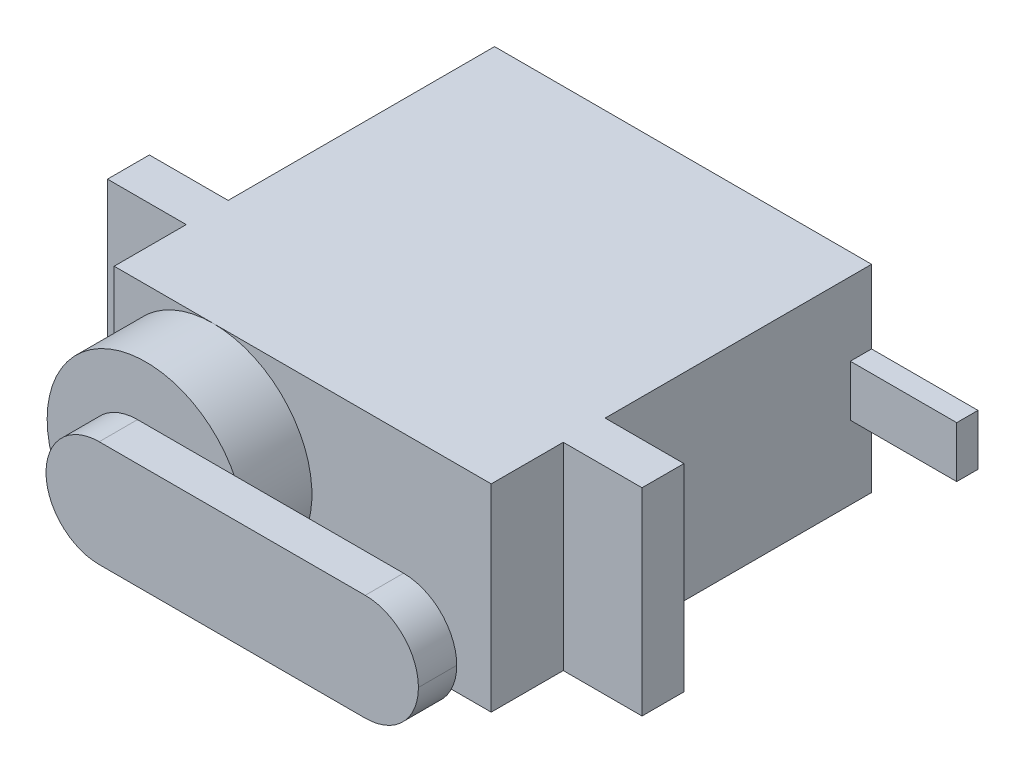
ISO-10303-21;
HEADER;
FILE_DESCRIPTION(('STEP AP214'),'2;1');
FILE_NAME('part.step','',(''),(''),'','','');
FILE_SCHEMA(('AUTOMOTIVE_DESIGN { 1 0 10303 214 1 1 1 1 }'));
ENDSEC;
DATA;
#1=APPLICATION_CONTEXT('core data for automotive mechanical design processes');
#2=APPLICATION_PROTOCOL_DEFINITION('international standard','automotive_design',2000,#1);
#3=PRODUCT_CONTEXT('',#1,'mechanical');
#4=PRODUCT('Part','Part','',(#3));
#5=PRODUCT_RELATED_PRODUCT_CATEGORY('part','',(#4));
#6=PRODUCT_DEFINITION_FORMATION('','',#4);
#7=PRODUCT_DEFINITION_CONTEXT('part definition',#1,'design');
#8=PRODUCT_DEFINITION('design','',#6,#7);
#9=PRODUCT_DEFINITION_SHAPE('','',#8);
#10=(LENGTH_UNIT() NAMED_UNIT(*) SI_UNIT(.MILLI.,.METRE.));
#11=(NAMED_UNIT(*) PLANE_ANGLE_UNIT() SI_UNIT($,.RADIAN.));
#12=(NAMED_UNIT(*) SI_UNIT($,.STERADIAN.) SOLID_ANGLE_UNIT());
#13=UNCERTAINTY_MEASURE_WITH_UNIT(LENGTH_MEASURE(1.E-05),#10,'distance_accuracy_value','');
#14=(GEOMETRIC_REPRESENTATION_CONTEXT(3) GLOBAL_UNCERTAINTY_ASSIGNED_CONTEXT((#13)) GLOBAL_UNIT_ASSIGNED_CONTEXT((#10,
#11,#12)) REPRESENTATION_CONTEXT('',''));
#15=CARTESIAN_POINT('',(0.,0.,0.));
#16=DIRECTION('',(0.,0.,1.));
#17=DIRECTION('',(1.,0.,0.));
#18=AXIS2_PLACEMENT_3D('',#15,#16,#17);
#19=CARTESIAN_POINT('',(11.25,5.9,15.9));
#20=DIRECTION('',(-1.,0.,0.));
#21=DIRECTION('',(0.,0.,1.));
#22=AXIS2_PLACEMENT_3D('',#19,#20,#21);
#23=PLANE('',#22);
#24=DIRECTION('',(0.,0.,-1.));
#25=VECTOR('',#24,1.);
#26=CARTESIAN_POINT('',(11.25,-1.524,1.27));
#27=LINE('',#26,#25);
#28=CARTESIAN_POINT('',(11.25,-1.524,1.27));
#29=VERTEX_POINT('',#28);
#30=CARTESIAN_POINT('',(11.25,-1.524,0.));
#31=VERTEX_POINT('',#30);
#32=EDGE_CURVE('E62',#29,#31,#27,.T.);
#33=ORIENTED_EDGE('',*,*,#32,.F.);
#34=DIRECTION('',(0.,-1.,0.));
#35=VECTOR('',#34,1.);
#36=CARTESIAN_POINT('',(11.25,1.524,1.27));
#37=LINE('',#36,#35);
#38=CARTESIAN_POINT('',(11.25,1.524,1.27));
#39=VERTEX_POINT('',#38);
#40=EDGE_CURVE('E67',#39,#29,#37,.T.);
#41=ORIENTED_EDGE('',*,*,#40,.F.);
#42=DIRECTION('',(0.,0.,1.));
#43=VECTOR('',#42,1.);
#44=CARTESIAN_POINT('',(11.25,1.524,1.27));
#45=LINE('',#44,#43);
#46=CARTESIAN_POINT('',(11.25,1.524,0.));
#47=VERTEX_POINT('',#46);
#48=EDGE_CURVE('E218',#47,#39,#45,.T.);
#49=ORIENTED_EDGE('',*,*,#48,.F.);
#50=DIRECTION('',(0.,1.,0.));
#51=VECTOR('',#50,1.);
#52=CARTESIAN_POINT('',(11.25,5.9,0.));
#53=LINE('',#52,#51);
#54=CARTESIAN_POINT('',(11.25,5.9,0.));
#55=VERTEX_POINT('',#54);
#56=EDGE_CURVE('E366',#47,#55,#53,.T.);
#57=ORIENTED_EDGE('',*,*,#56,.T.);
#58=DIRECTION('',(0.,0.,-1.));
#59=VECTOR('',#58,1.);
#60=CARTESIAN_POINT('',(11.25,5.9,15.9));
#61=LINE('',#60,#59);
#62=CARTESIAN_POINT('',(11.25,5.9,15.9));
#63=VERTEX_POINT('',#62);
#64=EDGE_CURVE('E399',#63,#55,#61,.T.);
#65=ORIENTED_EDGE('',*,*,#64,.F.);
#66=DIRECTION('',(0.,1.,0.));
#67=VECTOR('',#66,1.);
#68=CARTESIAN_POINT('',(11.25,5.9,15.9));
#69=LINE('',#68,#67);
#70=CARTESIAN_POINT('',(11.25,-5.9,15.9));
#71=VERTEX_POINT('',#70);
#72=EDGE_CURVE('E367',#71,#63,#69,.T.);
#73=ORIENTED_EDGE('',*,*,#72,.F.);
#74=DIRECTION('',(0.,0.,-1.));
#75=VECTOR('',#74,1.);
#76=CARTESIAN_POINT('',(11.25,-5.9,15.9));
#77=LINE('',#76,#75);
#78=CARTESIAN_POINT('',(11.25,-5.9,0.));
#79=VERTEX_POINT('',#78);
#80=EDGE_CURVE('E376',#71,#79,#77,.T.);
#81=ORIENTED_EDGE('',*,*,#80,.T.);
#82=EDGE_CURVE('E377',#79,#31,#53,.T.);
#83=ORIENTED_EDGE('',*,*,#82,.T.);
#84=EDGE_LOOP('',(#33,#41,#49,#57,#65,#73,#81,#83));
#85=FACE_BOUND('',#84,.T.);
#86=ADVANCED_FACE('F45',(#85),#23,.F.);
#87=CARTESIAN_POINT('',(0.,0.,22.7));
#88=DIRECTION('',(0.,0.,-1.));
#89=DIRECTION('',(-1.,0.,0.));
#90=AXIS2_PLACEMENT_3D('',#87,#88,#89);
#91=PLANE('',#90);
#92=CARTESIAN_POINT('',(-5.35000000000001,0.,22.7));
#93=DIRECTION('',(0.,0.,1.));
#94=DIRECTION('',(1.,0.,0.));
#95=AXIS2_PLACEMENT_3D('',#92,#93,#94);
#96=CIRCLE('',#95,5.9);
#97=CARTESIAN_POINT('',(-5.35000000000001,5.9,22.7));
#98=VERTEX_POINT('',#97);
#99=CARTESIAN_POINT('',(-11.25,0.,22.7));
#100=VERTEX_POINT('',#99);
#101=EDGE_CURVE('E262',#98,#100,#96,.T.);
#102=ORIENTED_EDGE('',*,*,#101,.F.);
#103=DIRECTION('',(-1.,0.,0.));
#104=VECTOR('',#103,1.);
#105=CARTESIAN_POINT('',(-11.25,5.9,22.7));
#106=LINE('',#105,#104);
#107=CARTESIAN_POINT('',(-11.25,5.9,22.7));
#108=VERTEX_POINT('',#107);
#109=EDGE_CURVE('E291',#98,#108,#106,.T.);
#110=ORIENTED_EDGE('',*,*,#109,.T.);
#111=DIRECTION('',(0.,-1.,0.));
#112=VECTOR('',#111,1.);
#113=CARTESIAN_POINT('',(-11.25,-5.9,22.7));
#114=LINE('',#113,#112);
#115=EDGE_CURVE('E278',#108,#100,#114,.T.);
#116=ORIENTED_EDGE('',*,*,#115,.T.);
#117=EDGE_LOOP('',(#102,#110,#116));
#118=FACE_BOUND('',#117,.T.);
#119=ADVANCED_FACE('F454',(#118),#91,.F.);
#120=CARTESIAN_POINT('',(-5.35,-5.9,22.7));
#121=VERTEX_POINT('',#120);
#122=EDGE_CURVE('E268',#100,#121,#96,.T.);
#123=ORIENTED_EDGE('',*,*,#122,.F.);
#124=CARTESIAN_POINT('',(-11.25,-5.9,22.7));
#125=VERTEX_POINT('',#124);
#126=EDGE_CURVE('E283',#100,#125,#114,.T.);
#127=ORIENTED_EDGE('',*,*,#126,.T.);
#128=DIRECTION('',(1.,0.,0.));
#129=VECTOR('',#128,1.);
#130=CARTESIAN_POINT('',(-11.25,-5.9,22.7));
#131=LINE('',#130,#129);
#132=EDGE_CURVE('E284',#125,#121,#131,.T.);
#133=ORIENTED_EDGE('',*,*,#132,.T.);
#134=EDGE_LOOP('',(#123,#127,#133));
#135=FACE_BOUND('',#134,.T.);
#136=ADVANCED_FACE('F461',(#135),#91,.F.);
#137=CARTESIAN_POINT('',(0.,0.,18.4));
#138=DIRECTION('',(0.,0.,-1.));
#139=DIRECTION('',(-1.,0.,0.));
#140=AXIS2_PLACEMENT_3D('',#137,#138,#139);
#141=PLANE('',#140);
#142=DIRECTION('',(0.,-1.,0.));
#143=VECTOR('',#142,1.);
#144=CARTESIAN_POINT('',(-11.25,-5.9,18.4));
#145=LINE('',#144,#143);
#146=CARTESIAN_POINT('',(-11.25,5.9,18.4));
#147=VERTEX_POINT('',#146);
#148=CARTESIAN_POINT('',(-11.25,-5.9,18.4));
#149=VERTEX_POINT('',#148);
#150=EDGE_CURVE('E273',#147,#149,#145,.T.);
#151=ORIENTED_EDGE('',*,*,#150,.F.);
#152=DIRECTION('',(-1.,0.,0.));
#153=VECTOR('',#152,1.);
#154=CARTESIAN_POINT('',(-15.95,5.9,18.4));
#155=LINE('',#154,#153);
#156=CARTESIAN_POINT('',(-15.95,5.9,18.4));
#157=VERTEX_POINT('',#156);
#158=EDGE_CURVE('E331',#147,#157,#155,.T.);
#159=ORIENTED_EDGE('',*,*,#158,.T.);
#160=DIRECTION('',(0.,-1.,0.));
#161=VECTOR('',#160,1.);
#162=CARTESIAN_POINT('',(-15.95,-5.9,18.4));
#163=LINE('',#162,#161);
#164=CARTESIAN_POINT('',(-15.95,-5.9,18.4));
#165=VERTEX_POINT('',#164);
#166=EDGE_CURVE('E319',#157,#165,#163,.T.);
#167=ORIENTED_EDGE('',*,*,#166,.T.);
#168=DIRECTION('',(1.,0.,0.));
#169=VECTOR('',#168,1.);
#170=CARTESIAN_POINT('',(-15.95,-5.9,18.4));
#171=LINE('',#170,#169);
#172=EDGE_CURVE('E325',#165,#149,#171,.T.);
#173=ORIENTED_EDGE('',*,*,#172,.T.);
#174=EDGE_LOOP('',(#151,#159,#167,#173));
#175=FACE_BOUND('',#174,.T.);
#176=ADVANCED_FACE('F605',(#175),#141,.F.);
#177=DIRECTION('',(0.,1.,0.));
#178=VECTOR('',#177,1.);
#179=CARTESIAN_POINT('',(11.25,-5.89999999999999,18.4));
#180=LINE('',#179,#178);
#181=CARTESIAN_POINT('',(11.25,-5.9,18.4));
#182=VERTEX_POINT('',#181);
#183=CARTESIAN_POINT('',(11.25,5.9,18.4));
#184=VERTEX_POINT('',#183);
#185=EDGE_CURVE('E299',#182,#184,#180,.T.);
#186=ORIENTED_EDGE('',*,*,#185,.F.);
#187=CARTESIAN_POINT('',(15.95,-5.9,18.4));
#188=VERTEX_POINT('',#187);
#189=EDGE_CURVE('E323',#182,#188,#171,.T.);
#190=ORIENTED_EDGE('',*,*,#189,.T.);
#191=DIRECTION('',(0.,1.,0.));
#192=VECTOR('',#191,1.);
#193=CARTESIAN_POINT('',(15.95,-5.9,18.4));
#194=LINE('',#193,#192);
#195=CARTESIAN_POINT('',(15.95,5.9,18.4));
#196=VERTEX_POINT('',#195);
#197=EDGE_CURVE('E328',#188,#196,#194,.T.);
#198=ORIENTED_EDGE('',*,*,#197,.T.);
#199=EDGE_CURVE('E332',#196,#184,#155,.T.);
#200=ORIENTED_EDGE('',*,*,#199,.T.);
#201=EDGE_LOOP('',(#186,#190,#198,#200));
#202=FACE_BOUND('',#201,.T.);
#203=ADVANCED_FACE('F653',(#202),#141,.F.);
#204=CARTESIAN_POINT('',(-11.25,5.9,15.9));
#205=DIRECTION('',(0.,-1.,0.));
#206=DIRECTION('',(0.,0.,-1.));
#207=AXIS2_PLACEMENT_3D('',#204,#205,#206);
#208=PLANE('',#207);
#209=DIRECTION('',(-1.,0.,0.));
#210=VECTOR('',#209,1.);
#211=CARTESIAN_POINT('',(-11.25,5.9,0.));
#212=LINE('',#211,#210);
#213=CARTESIAN_POINT('',(-11.25,5.9,0.));
#214=VERTEX_POINT('',#213);
#215=EDGE_CURVE('E380',#55,#214,#212,.T.);
#216=ORIENTED_EDGE('',*,*,#215,.T.);
#217=DIRECTION('',(0.,0.,-1.));
#218=VECTOR('',#217,1.);
#219=CARTESIAN_POINT('',(-11.25,5.9,15.9));
#220=LINE('',#219,#218);
#221=CARTESIAN_POINT('',(-11.25,5.9,15.9));
#222=VERTEX_POINT('',#221);
#223=EDGE_CURVE('E395',#222,#214,#220,.T.);
#224=ORIENTED_EDGE('',*,*,#223,.F.);
#225=DIRECTION('',(-1.,0.,0.));
#226=VECTOR('',#225,1.);
#227=CARTESIAN_POINT('',(-15.95,5.9,15.9));
#228=LINE('',#227,#226);
#229=CARTESIAN_POINT('',(-15.95,5.9,15.9));
#230=VERTEX_POINT('',#229);
#231=EDGE_CURVE('E347',#222,#230,#228,.T.);
#232=ORIENTED_EDGE('',*,*,#231,.T.);
#233=DIRECTION('',(0.,0.,-1.));
#234=VECTOR('',#233,1.);
#235=CARTESIAN_POINT('',(-15.95,5.9,18.4));
#236=LINE('',#235,#234);
#237=EDGE_CURVE('E335',#157,#230,#236,.T.);
#238=ORIENTED_EDGE('',*,*,#237,.F.);
#239=ORIENTED_EDGE('',*,*,#158,.F.);
#240=DIRECTION('',(0.,0.,-1.));
#241=VECTOR('',#240,1.);
#242=CARTESIAN_POINT('',(-11.25,5.9,22.7));
#243=LINE('',#242,#241);
#244=EDGE_CURVE('E295',#108,#147,#243,.T.);
#245=ORIENTED_EDGE('',*,*,#244,.F.);
#246=ORIENTED_EDGE('',*,*,#109,.F.);
#247=CARTESIAN_POINT('',(11.25,5.9,22.7));
#248=VERTEX_POINT('',#247);
#249=EDGE_CURVE('E292',#248,#98,#106,.T.);
#250=ORIENTED_EDGE('',*,*,#249,.F.);
#251=DIRECTION('',(0.,0.,-1.));
#252=VECTOR('',#251,1.);
#253=CARTESIAN_POINT('',(11.25,5.9,22.7));
#254=LINE('',#253,#252);
#255=EDGE_CURVE('E306',#248,#184,#254,.T.);
#256=ORIENTED_EDGE('',*,*,#255,.T.);
#257=ORIENTED_EDGE('',*,*,#199,.F.);
#258=DIRECTION('',(0.,0.,-1.));
#259=VECTOR('',#258,1.);
#260=CARTESIAN_POINT('',(15.95,5.9,18.4));
#261=LINE('',#260,#259);
#262=CARTESIAN_POINT('',(15.95,5.9,15.9));
#263=VERTEX_POINT('',#262);
#264=EDGE_CURVE('E354',#196,#263,#261,.T.);
#265=ORIENTED_EDGE('',*,*,#264,.T.);
#266=EDGE_CURVE('E324',#263,#63,#228,.T.);
#267=ORIENTED_EDGE('',*,*,#266,.T.);
#268=ORIENTED_EDGE('',*,*,#64,.T.);
#269=EDGE_LOOP('',(#216,#224,#232,#238,#239,#245,#246,#250,#256,#257,#265,#267,#268));
#270=FACE_BOUND('',#269,.T.);
#271=ADVANCED_FACE('F466',(#270),#208,.F.);
#272=CARTESIAN_POINT('',(-11.25,5.9,15.9));
#273=DIRECTION('',(1.,0.,0.));
#274=DIRECTION('',(0.,0.,-1.));
#275=AXIS2_PLACEMENT_3D('',#272,#273,#274);
#276=PLANE('',#275);
#277=DIRECTION('',(0.,-1.,0.));
#278=VECTOR('',#277,1.);
#279=CARTESIAN_POINT('',(-11.25,5.9,0.));
#280=LINE('',#279,#278);
#281=CARTESIAN_POINT('',(-11.25,-5.9,0.));
#282=VERTEX_POINT('',#281);
#283=EDGE_CURVE('E383',#214,#282,#280,.T.);
#284=ORIENTED_EDGE('',*,*,#283,.T.);
#285=DIRECTION('',(0.,0.,-1.));
#286=VECTOR('',#285,1.);
#287=CARTESIAN_POINT('',(-11.25,-5.9,15.9));
#288=LINE('',#287,#286);
#289=CARTESIAN_POINT('',(-11.25,-5.9,15.9));
#290=VERTEX_POINT('',#289);
#291=EDGE_CURVE('E391',#290,#282,#288,.T.);
#292=ORIENTED_EDGE('',*,*,#291,.F.);
#293=DIRECTION('',(0.,-1.,0.));
#294=VECTOR('',#293,1.);
#295=CARTESIAN_POINT('',(-11.25,5.9,15.9));
#296=LINE('',#295,#294);
#297=EDGE_CURVE('E371',#222,#290,#296,.T.);
#298=ORIENTED_EDGE('',*,*,#297,.F.);
#299=ORIENTED_EDGE('',*,*,#223,.T.);
#300=EDGE_LOOP('',(#284,#292,#298,#299));
#301=FACE_BOUND('',#300,.T.);
#302=ADVANCED_FACE('F642',(#301),#276,.F.);
#303=CARTESIAN_POINT('',(-11.25,-5.9,15.9));
#304=DIRECTION('',(0.,1.,0.));
#305=DIRECTION('',(0.,0.,1.));
#306=AXIS2_PLACEMENT_3D('',#303,#304,#305);
#307=PLANE('',#306);
#308=DIRECTION('',(1.,0.,0.));
#309=VECTOR('',#308,1.);
#310=CARTESIAN_POINT('',(-11.25,-5.9,0.));
#311=LINE('',#310,#309);
#312=EDGE_CURVE('E372',#282,#79,#311,.T.);
#313=ORIENTED_EDGE('',*,*,#312,.T.);
#314=ORIENTED_EDGE('',*,*,#80,.F.);
#315=DIRECTION('',(1.,0.,0.));
#316=VECTOR('',#315,1.);
#317=CARTESIAN_POINT('',(-15.95,-5.9,15.9));
#318=LINE('',#317,#316);
#319=CARTESIAN_POINT('',(15.95,-5.9,15.9));
#320=VERTEX_POINT('',#319);
#321=EDGE_CURVE('E339',#71,#320,#318,.T.);
#322=ORIENTED_EDGE('',*,*,#321,.T.);
#323=DIRECTION('',(0.,0.,-1.));
#324=VECTOR('',#323,1.);
#325=CARTESIAN_POINT('',(15.95,-5.9,18.4));
#326=LINE('',#325,#324);
#327=EDGE_CURVE('E358',#188,#320,#326,.T.);
#328=ORIENTED_EDGE('',*,*,#327,.F.);
#329=ORIENTED_EDGE('',*,*,#189,.F.);
#330=DIRECTION('',(0.,0.,-1.));
#331=VECTOR('',#330,1.);
#332=CARTESIAN_POINT('',(11.25,-5.89999999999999,22.7));
#333=LINE('',#332,#331);
#334=CARTESIAN_POINT('',(11.25,-5.89999999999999,22.7));
#335=VERTEX_POINT('',#334);
#336=EDGE_CURVE('E310',#335,#182,#333,.T.);
#337=ORIENTED_EDGE('',*,*,#336,.F.);
#338=EDGE_CURVE('E282',#121,#335,#131,.T.);
#339=ORIENTED_EDGE('',*,*,#338,.F.);
#340=ORIENTED_EDGE('',*,*,#132,.F.);
#341=DIRECTION('',(0.,0.,-1.));
#342=VECTOR('',#341,1.);
#343=CARTESIAN_POINT('',(-11.25,-5.9,22.7));
#344=LINE('',#343,#342);
#345=EDGE_CURVE('E314',#125,#149,#344,.T.);
#346=ORIENTED_EDGE('',*,*,#345,.T.);
#347=ORIENTED_EDGE('',*,*,#172,.F.);
#348=DIRECTION('',(0.,0.,-1.));
#349=VECTOR('',#348,1.);
#350=CARTESIAN_POINT('',(-15.95,-5.9,18.4));
#351=LINE('',#350,#349);
#352=CARTESIAN_POINT('',(-15.95,-5.9,15.9));
#353=VERTEX_POINT('',#352);
#354=EDGE_CURVE('E362',#165,#353,#351,.T.);
#355=ORIENTED_EDGE('',*,*,#354,.T.);
#356=EDGE_CURVE('E340',#353,#290,#318,.T.);
#357=ORIENTED_EDGE('',*,*,#356,.T.);
#358=ORIENTED_EDGE('',*,*,#291,.T.);
#359=EDGE_LOOP('',(#313,#314,#322,#328,#329,#337,#339,#340,#346,#347,#355,#357,#358));
#360=FACE_BOUND('',#359,.T.);
#361=ADVANCED_FACE('F514',(#360),#307,.F.);
#362=CARTESIAN_POINT('',(0.,0.,0.));
#363=DIRECTION('',(0.,0.,1.));
#364=DIRECTION('',(1.,0.,0.));
#365=AXIS2_PLACEMENT_3D('',#362,#363,#364);
#366=PLANE('',#365);
#367=ORIENTED_EDGE('',*,*,#82,.F.);
#368=ORIENTED_EDGE('',*,*,#312,.F.);
#369=ORIENTED_EDGE('',*,*,#283,.F.);
#370=ORIENTED_EDGE('',*,*,#215,.F.);
#371=ORIENTED_EDGE('',*,*,#56,.F.);
#372=DIRECTION('',(-1.,0.,0.));
#373=VECTOR('',#372,1.);
#374=CARTESIAN_POINT('',(17.6,1.524,0.));
#375=LINE('',#374,#373);
#376=CARTESIAN_POINT('',(17.6,1.524,0.));
#377=VERTEX_POINT('',#376);
#378=EDGE_CURVE('E227',#377,#47,#375,.T.);
#379=ORIENTED_EDGE('',*,*,#378,.F.);
#380=DIRECTION('',(0.,1.,0.));
#381=VECTOR('',#380,1.);
#382=CARTESIAN_POINT('',(17.6,1.524,0.));
#383=LINE('',#382,#381);
#384=CARTESIAN_POINT('',(17.6,-1.524,0.));
#385=VERTEX_POINT('',#384);
#386=EDGE_CURVE('E207',#385,#377,#383,.T.);
#387=ORIENTED_EDGE('',*,*,#386,.F.);
#388=DIRECTION('',(-1.,0.,0.));
#389=VECTOR('',#388,1.);
#390=CARTESIAN_POINT('',(17.6,-1.524,0.));
#391=LINE('',#390,#389);
#392=EDGE_CURVE('E203',#385,#31,#391,.T.);
#393=ORIENTED_EDGE('',*,*,#392,.T.);
#394=EDGE_LOOP('',(#367,#368,#369,#370,#371,#379,#387,#393));
#395=FACE_BOUND('',#394,.T.);
#396=ADVANCED_FACE('F511',(#395),#366,.F.);
#397=CARTESIAN_POINT('',(0.,0.,15.9));
#398=DIRECTION('',(0.,0.,-1.));
#399=DIRECTION('',(-1.,0.,0.));
#400=AXIS2_PLACEMENT_3D('',#397,#398,#399);
#401=PLANE('',#400);
#402=ORIENTED_EDGE('',*,*,#321,.F.);
#403=ORIENTED_EDGE('',*,*,#72,.T.);
#404=ORIENTED_EDGE('',*,*,#266,.F.);
#405=DIRECTION('',(0.,1.,0.));
#406=VECTOR('',#405,1.);
#407=CARTESIAN_POINT('',(15.95,-5.9,15.9));
#408=LINE('',#407,#406);
#409=EDGE_CURVE('E344',#320,#263,#408,.T.);
#410=ORIENTED_EDGE('',*,*,#409,.F.);
#411=EDGE_LOOP('',(#402,#403,#404,#410));
#412=FACE_BOUND('',#411,.T.);
#413=ADVANCED_FACE('F513',(#412),#401,.T.);
#414=CARTESIAN_POINT('',(-15.95,-5.9,18.4));
#415=DIRECTION('',(1.,0.,0.));
#416=DIRECTION('',(0.,0.,-1.));
#417=AXIS2_PLACEMENT_3D('',#414,#415,#416);
#418=PLANE('',#417);
#419=DIRECTION('',(0.,-1.,0.));
#420=VECTOR('',#419,1.);
#421=CARTESIAN_POINT('',(-15.95,-5.9,15.9));
#422=LINE('',#421,#420);
#423=EDGE_CURVE('E318',#230,#353,#422,.T.);
#424=ORIENTED_EDGE('',*,*,#423,.T.);
#425=ORIENTED_EDGE('',*,*,#354,.F.);
#426=ORIENTED_EDGE('',*,*,#166,.F.);
#427=ORIENTED_EDGE('',*,*,#237,.T.);
#428=EDGE_LOOP('',(#424,#425,#426,#427));
#429=FACE_BOUND('',#428,.T.);
#430=ADVANCED_FACE('F687',(#429),#418,.F.);
#431=CARTESIAN_POINT('',(15.95,-5.9,18.4));
#432=DIRECTION('',(-1.,0.,0.));
#433=DIRECTION('',(0.,0.,1.));
#434=AXIS2_PLACEMENT_3D('',#431,#432,#433);
#435=PLANE('',#434);
#436=ORIENTED_EDGE('',*,*,#409,.T.);
#437=ORIENTED_EDGE('',*,*,#264,.F.);
#438=ORIENTED_EDGE('',*,*,#197,.F.);
#439=ORIENTED_EDGE('',*,*,#327,.T.);
#440=EDGE_LOOP('',(#436,#437,#438,#439));
#441=FACE_BOUND('',#440,.T.);
#442=ADVANCED_FACE('F677',(#441),#435,.F.);
#443=ORIENTED_EDGE('',*,*,#231,.F.);
#444=ORIENTED_EDGE('',*,*,#297,.T.);
#445=ORIENTED_EDGE('',*,*,#356,.F.);
#446=ORIENTED_EDGE('',*,*,#423,.F.);
#447=EDGE_LOOP('',(#443,#444,#445,#446));
#448=FACE_BOUND('',#447,.T.);
#449=ADVANCED_FACE('F631',(#448),#401,.T.);
#450=CARTESIAN_POINT('',(-11.25,-5.9,22.7));
#451=DIRECTION('',(1.,0.,0.));
#452=DIRECTION('',(0.,1.,0.));
#453=AXIS2_PLACEMENT_3D('',#450,#451,#452);
#454=PLANE('',#453);
#455=ORIENTED_EDGE('',*,*,#150,.T.);
#456=ORIENTED_EDGE('',*,*,#345,.F.);
#457=ORIENTED_EDGE('',*,*,#126,.F.);
#458=ORIENTED_EDGE('',*,*,#115,.F.);
#459=ORIENTED_EDGE('',*,*,#244,.T.);
#460=EDGE_LOOP('',(#455,#456,#457,#458,#459));
#461=FACE_BOUND('',#460,.T.);
#462=ADVANCED_FACE('F621',(#461),#454,.F.);
#463=CARTESIAN_POINT('',(11.25,-5.89999999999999,22.7));
#464=DIRECTION('',(-1.,0.,0.));
#465=DIRECTION('',(0.,-1.,0.));
#466=AXIS2_PLACEMENT_3D('',#463,#464,#465);
#467=PLANE('',#466);
#468=ORIENTED_EDGE('',*,*,#185,.T.);
#469=ORIENTED_EDGE('',*,*,#255,.F.);
#470=DIRECTION('',(0.,1.,0.));
#471=VECTOR('',#470,1.);
#472=CARTESIAN_POINT('',(11.25,-5.89999999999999,22.7));
#473=LINE('',#472,#471);
#474=EDGE_CURVE('E288',#335,#248,#473,.T.);
#475=ORIENTED_EDGE('',*,*,#474,.F.);
#476=ORIENTED_EDGE('',*,*,#336,.T.);
#477=EDGE_LOOP('',(#468,#469,#475,#476));
#478=FACE_BOUND('',#477,.T.);
#479=ADVANCED_FACE('F612',(#478),#467,.F.);
#480=EDGE_CURVE('E277',#121,#98,#96,.T.);
#481=ORIENTED_EDGE('',*,*,#480,.F.);
#482=ORIENTED_EDGE('',*,*,#338,.T.);
#483=ORIENTED_EDGE('',*,*,#474,.T.);
#484=ORIENTED_EDGE('',*,*,#249,.T.);
#485=EDGE_LOOP('',(#481,#482,#483,#484));
#486=FACE_BOUND('',#485,.T.);
#487=ADVANCED_FACE('F464',(#486),#91,.F.);
#488=CARTESIAN_POINT('',(-5.35000000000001,0.,26.7));
#489=DIRECTION('',(0.,0.,-1.));
#490=DIRECTION('',(-1.,0.,0.));
#491=AXIS2_PLACEMENT_3D('',#488,#489,#490);
#492=CYLINDRICAL_SURFACE('',#491,5.9);
#493=CARTESIAN_POINT('',(-5.35000000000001,0.,26.7));
#494=DIRECTION('',(0.,0.,1.));
#495=DIRECTION('',(1.,0.,0.));
#496=AXIS2_PLACEMENT_3D('',#493,#494,#495);
#497=CIRCLE('',#496,5.9);
#498=CARTESIAN_POINT('',(0.549999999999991,0.,26.7));
#499=VERTEX_POINT('',#498);
#500=EDGE_CURVE('E269',#499,#499,#497,.T.);
#501=ORIENTED_EDGE('',*,*,#500,.F.);
#502=EDGE_LOOP('',(#501));
#503=FACE_BOUND('',#502,.T.);
#504=ORIENTED_EDGE('',*,*,#101,.T.);
#505=ORIENTED_EDGE('',*,*,#122,.T.);
#506=ORIENTED_EDGE('',*,*,#480,.T.);
#507=EDGE_LOOP('',(#504,#505,#506));
#508=FACE_BOUND('',#507,.T.);
#509=ADVANCED_FACE('F578',(#503,#508),#492,.T.);
#510=CARTESIAN_POINT('',(-5.35000000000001,0.,26.7));
#511=DIRECTION('',(0.,0.,1.));
#512=DIRECTION('',(1.,0.,0.));
#513=AXIS2_PLACEMENT_3D('',#510,#511,#512);
#514=PLANE('',#513);
#515=CARTESIAN_POINT('',(-5.35000000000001,0.,26.7));
#516=DIRECTION('',(0.,0.,1.));
#517=DIRECTION('',(1.,0.,0.));
#518=AXIS2_PLACEMENT_3D('',#515,#516,#517);
#519=CIRCLE('',#518,2.3);
#520=CARTESIAN_POINT('',(-3.05000000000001,0.,26.7));
#521=VERTEX_POINT('',#520);
#522=EDGE_CURVE('E263',#521,#521,#519,.T.);
#523=ORIENTED_EDGE('',*,*,#522,.F.);
#524=EDGE_LOOP('',(#523));
#525=FACE_BOUND('',#524,.T.);
#526=ORIENTED_EDGE('',*,*,#500,.T.);
#527=EDGE_LOOP('',(#526));
#528=FACE_BOUND('',#527,.T.);
#529=ADVANCED_FACE('F568',(#525,#528),#514,.T.);
#530=CARTESIAN_POINT('',(-5.35000000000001,0.,27.208));
#531=DIRECTION('',(0.,0.,-1.));
#532=DIRECTION('',(-1.,0.,0.));
#533=AXIS2_PLACEMENT_3D('',#530,#531,#532);
#534=CYLINDRICAL_SURFACE('',#533,2.3);
#535=CARTESIAN_POINT('',(-5.35000000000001,0.,27.208));
#536=DIRECTION('',(0.,0.,1.));
#537=DIRECTION('',(1.,0.,0.));
#538=AXIS2_PLACEMENT_3D('',#535,#536,#537);
#539=CIRCLE('',#538,2.3);
#540=CARTESIAN_POINT('',(-3.05000000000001,0.,27.208));
#541=VERTEX_POINT('',#540);
#542=EDGE_CURVE('E258',#541,#541,#539,.T.);
#543=ORIENTED_EDGE('',*,*,#542,.F.);
#544=EDGE_LOOP('',(#543));
#545=FACE_BOUND('',#544,.T.);
#546=ORIENTED_EDGE('',*,*,#522,.T.);
#547=EDGE_LOOP('',(#546));
#548=FACE_BOUND('',#547,.T.);
#549=ADVANCED_FACE('F451',(#545,#548),#534,.T.);
#550=CARTESIAN_POINT('',(-5.35000000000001,3.175,29.494));
#551=DIRECTION('',(0.,-1.,0.));
#552=DIRECTION('',(1.,0.,0.));
#553=AXIS2_PLACEMENT_3D('',#550,#551,#552);
#554=PLANE('',#553);
#555=DIRECTION('',(-1.,0.,0.));
#556=VECTOR('',#555,1.);
#557=CARTESIAN_POINT('',(-5.35000000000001,3.175,29.494));
#558=LINE('',#557,#556);
#559=CARTESIAN_POINT('',(10.525,3.175,29.494));
#560=VERTEX_POINT('',#559);
#561=CARTESIAN_POINT('',(-5.35000000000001,3.175,29.494));
#562=VERTEX_POINT('',#561);
#563=EDGE_CURVE('E231',#560,#562,#558,.T.);
#564=ORIENTED_EDGE('',*,*,#563,.F.);
#565=DIRECTION('',(0.,0.,-1.));
#566=VECTOR('',#565,1.);
#567=CARTESIAN_POINT('',(10.525,3.175,29.494));
#568=LINE('',#567,#566);
#569=CARTESIAN_POINT('',(10.525,3.175,27.208));
#570=VERTEX_POINT('',#569);
#571=EDGE_CURVE('E267',#560,#570,#568,.T.);
#572=ORIENTED_EDGE('',*,*,#571,.T.);
#573=DIRECTION('',(-1.,0.,0.));
#574=VECTOR('',#573,1.);
#575=CARTESIAN_POINT('',(-5.35000000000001,3.175,27.208));
#576=LINE('',#575,#574);
#577=CARTESIAN_POINT('',(-5.35000000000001,3.175,27.208));
#578=VERTEX_POINT('',#577);
#579=EDGE_CURVE('E226',#570,#578,#576,.T.);
#580=ORIENTED_EDGE('',*,*,#579,.T.);
#581=DIRECTION('',(0.,0.,-1.));
#582=VECTOR('',#581,1.);
#583=CARTESIAN_POINT('',(-5.35000000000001,3.175,29.494));
#584=LINE('',#583,#582);
#585=EDGE_CURVE('E254',#562,#578,#584,.T.);
#586=ORIENTED_EDGE('',*,*,#585,.F.);
#587=EDGE_LOOP('',(#564,#572,#580,#586));
#588=FACE_BOUND('',#587,.T.);
#589=ADVANCED_FACE('F426',(#588),#554,.F.);
#590=CARTESIAN_POINT('',(-5.35000000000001,0.,29.494));
#591=DIRECTION('',(0.,0.,-1.));
#592=DIRECTION('',(-1.,0.,0.));
#593=AXIS2_PLACEMENT_3D('',#590,#591,#592);
#594=CYLINDRICAL_SURFACE('',#593,3.175);
#595=CARTESIAN_POINT('',(-5.35000000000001,0.,27.208));
#596=DIRECTION('',(0.,0.,1.));
#597=DIRECTION('',(1.,0.,0.));
#598=AXIS2_PLACEMENT_3D('',#595,#596,#597);
#599=CIRCLE('',#598,3.175);
#600=CARTESIAN_POINT('',(-5.35000000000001,-3.175,27.208));
#601=VERTEX_POINT('',#600);
#602=EDGE_CURVE('E245',#578,#601,#599,.T.);
#603=ORIENTED_EDGE('',*,*,#602,.T.);
#604=DIRECTION('',(0.,0.,-1.));
#605=VECTOR('',#604,1.);
#606=CARTESIAN_POINT('',(-5.35000000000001,-3.175,29.494));
#607=LINE('',#606,#605);
#608=CARTESIAN_POINT('',(-5.35000000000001,-3.175,29.494));
#609=VERTEX_POINT('',#608);
#610=EDGE_CURVE('E242',#609,#601,#607,.T.);
#611=ORIENTED_EDGE('',*,*,#610,.F.);
#612=CARTESIAN_POINT('',(-5.35000000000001,0.,29.494));
#613=DIRECTION('',(0.,0.,1.));
#614=DIRECTION('',(1.,0.,0.));
#615=AXIS2_PLACEMENT_3D('',#612,#613,#614);
#616=CIRCLE('',#615,3.175);
#617=EDGE_CURVE('E234',#562,#609,#616,.T.);
#618=ORIENTED_EDGE('',*,*,#617,.F.);
#619=ORIENTED_EDGE('',*,*,#585,.T.);
#620=EDGE_LOOP('',(#603,#611,#618,#619));
#621=FACE_BOUND('',#620,.T.);
#622=ADVANCED_FACE('F442',(#621),#594,.T.);
#623=CARTESIAN_POINT('',(-5.35000000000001,-3.175,29.494));
#624=DIRECTION('',(0.,1.,0.));
#625=DIRECTION('',(0.,0.,1.));
#626=AXIS2_PLACEMENT_3D('',#623,#624,#625);
#627=PLANE('',#626);
#628=DIRECTION('',(1.,0.,0.));
#629=VECTOR('',#628,1.);
#630=CARTESIAN_POINT('',(-5.35000000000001,-3.175,27.208));
#631=LINE('',#630,#629);
#632=CARTESIAN_POINT('',(10.525,-3.175,27.208));
#633=VERTEX_POINT('',#632);
#634=EDGE_CURVE('E235',#601,#633,#631,.T.);
#635=ORIENTED_EDGE('',*,*,#634,.T.);
#636=DIRECTION('',(0.,0.,-1.));
#637=VECTOR('',#636,1.);
#638=CARTESIAN_POINT('',(10.525,-3.175,29.494));
#639=LINE('',#638,#637);
#640=CARTESIAN_POINT('',(10.525,-3.175,29.494));
#641=VERTEX_POINT('',#640);
#642=EDGE_CURVE('E11',#633,#641,#639,.F.);
#643=ORIENTED_EDGE('',*,*,#642,.T.);
#644=DIRECTION('',(1.,0.,0.));
#645=VECTOR('',#644,1.);
#646=CARTESIAN_POINT('',(-5.35000000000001,-3.175,29.494));
#647=LINE('',#646,#645);
#648=EDGE_CURVE('E238',#609,#641,#647,.T.);
#649=ORIENTED_EDGE('',*,*,#648,.F.);
#650=ORIENTED_EDGE('',*,*,#610,.T.);
#651=EDGE_LOOP('',(#635,#643,#649,#650));
#652=FACE_BOUND('',#651,.T.);
#653=ADVANCED_FACE('F439',(#652),#627,.F.);
#654=CARTESIAN_POINT('',(-5.35000000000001,0.,29.494));
#655=DIRECTION('',(0.,0.,1.));
#656=DIRECTION('',(1.,0.,0.));
#657=AXIS2_PLACEMENT_3D('',#654,#655,#656);
#658=PLANE('',#657);
#659=CARTESIAN_POINT('',(10.525,0.,29.494));
#660=DIRECTION('',(0.,0.,1.));
#661=DIRECTION('',(1.,0.,0.));
#662=AXIS2_PLACEMENT_3D('',#659,#660,#661);
#663=CIRCLE('',#662,3.175);
#664=CARTESIAN_POINT('',(13.7,0.,29.494));
#665=VERTEX_POINT('',#664);
#666=EDGE_CURVE('E412',#641,#665,#663,.T.);
#667=ORIENTED_EDGE('',*,*,#666,.T.);
#668=CARTESIAN_POINT('',(10.525,0.,29.494));
#669=DIRECTION('',(0.,0.,1.));
#670=DIRECTION('',(1.,0.,0.));
#671=AXIS2_PLACEMENT_3D('',#668,#669,#670);
#672=CIRCLE('',#671,3.175);
#673=EDGE_CURVE('E55',#665,#560,#672,.T.);
#674=ORIENTED_EDGE('',*,*,#673,.T.);
#675=ORIENTED_EDGE('',*,*,#563,.T.);
#676=ORIENTED_EDGE('',*,*,#617,.T.);
#677=ORIENTED_EDGE('',*,*,#648,.T.);
#678=EDGE_LOOP('',(#667,#674,#675,#676,#677));
#679=FACE_BOUND('',#678,.T.);
#680=ADVANCED_FACE('F419',(#679),#658,.T.);
#681=CARTESIAN_POINT('',(-5.35000000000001,0.,27.208));
#682=DIRECTION('',(0.,0.,1.));
#683=DIRECTION('',(1.,0.,0.));
#684=AXIS2_PLACEMENT_3D('',#681,#682,#683);
#685=PLANE('',#684);
#686=ORIENTED_EDGE('',*,*,#542,.T.);
#687=EDGE_LOOP('',(#686));
#688=FACE_BOUND('',#687,.T.);
#689=ORIENTED_EDGE('',*,*,#579,.F.);
#690=CARTESIAN_POINT('',(10.525,0.,27.208));
#691=DIRECTION('',(0.,0.,1.));
#692=DIRECTION('',(1.,0.,0.));
#693=AXIS2_PLACEMENT_3D('',#690,#691,#692);
#694=CIRCLE('',#693,3.175);
#695=CARTESIAN_POINT('',(13.7,0.,27.208));
#696=VERTEX_POINT('',#695);
#697=EDGE_CURVE('E409',#570,#696,#694,.F.);
#698=ORIENTED_EDGE('',*,*,#697,.T.);
#699=CARTESIAN_POINT('',(10.525,0.,27.208));
#700=DIRECTION('',(0.,0.,1.));
#701=DIRECTION('',(1.,0.,0.));
#702=AXIS2_PLACEMENT_3D('',#699,#700,#701);
#703=CIRCLE('',#702,3.175);
#704=EDGE_CURVE('E406',#696,#633,#703,.F.);
#705=ORIENTED_EDGE('',*,*,#704,.T.);
#706=ORIENTED_EDGE('',*,*,#634,.F.);
#707=ORIENTED_EDGE('',*,*,#602,.F.);
#708=EDGE_LOOP('',(#689,#698,#705,#706,#707));
#709=FACE_BOUND('',#708,.T.);
#710=ADVANCED_FACE('F432',(#688,#709),#685,.F.);
#711=CARTESIAN_POINT('',(10.525,0.,29.494));
#712=DIRECTION('',(0.,0.,-1.));
#713=DIRECTION('',(-1.,0.,0.));
#714=AXIS2_PLACEMENT_3D('',#711,#712,#713);
#715=CYLINDRICAL_SURFACE('',#714,3.175);
#716=DIRECTION('',(0.,0.,-1.));
#717=VECTOR('',#716,1.);
#718=CARTESIAN_POINT('',(13.7,0.,29.494));
#719=LINE('',#718,#717);
#720=EDGE_CURVE('E49',#665,#696,#719,.T.);
#721=ORIENTED_EDGE('',*,*,#720,.F.);
#722=ORIENTED_EDGE('',*,*,#666,.F.);
#723=ORIENTED_EDGE('',*,*,#642,.F.);
#724=ORIENTED_EDGE('',*,*,#704,.F.);
#725=EDGE_LOOP('',(#721,#722,#723,#724));
#726=FACE_BOUND('',#725,.T.);
#727=ADVANCED_FACE('F47',(#726),#715,.T.);
#728=CARTESIAN_POINT('',(10.525,0.,29.494));
#729=DIRECTION('',(0.,0.,-1.));
#730=DIRECTION('',(-1.,0.,0.));
#731=AXIS2_PLACEMENT_3D('',#728,#729,#730);
#732=CYLINDRICAL_SURFACE('',#731,3.175);
#733=ORIENTED_EDGE('',*,*,#673,.F.);
#734=ORIENTED_EDGE('',*,*,#720,.T.);
#735=ORIENTED_EDGE('',*,*,#697,.F.);
#736=ORIENTED_EDGE('',*,*,#571,.F.);
#737=EDGE_LOOP('',(#733,#734,#735,#736));
#738=FACE_BOUND('',#737,.T.);
#739=ADVANCED_FACE('F429',(#738),#732,.T.);
#740=CARTESIAN_POINT('',(17.6,1.524,1.27));
#741=DIRECTION('',(0.,0.,-1.));
#742=DIRECTION('',(0.,1.,0.));
#743=AXIS2_PLACEMENT_3D('',#740,#741,#742);
#744=PLANE('',#743);
#745=ORIENTED_EDGE('',*,*,#40,.T.);
#746=DIRECTION('',(-1.,0.,0.));
#747=VECTOR('',#746,1.);
#748=CARTESIAN_POINT('',(17.6,-1.524,1.27));
#749=LINE('',#748,#747);
#750=CARTESIAN_POINT('',(17.6,-1.524,1.27));
#751=VERTEX_POINT('',#750);
#752=EDGE_CURVE('E201',#751,#29,#749,.T.);
#753=ORIENTED_EDGE('',*,*,#752,.F.);
#754=DIRECTION('',(0.,-1.,0.));
#755=VECTOR('',#754,1.);
#756=CARTESIAN_POINT('',(17.6,1.524,1.27));
#757=LINE('',#756,#755);
#758=CARTESIAN_POINT('',(17.6,1.524,1.27));
#759=VERTEX_POINT('',#758);
#760=EDGE_CURVE('E208',#759,#751,#757,.T.);
#761=ORIENTED_EDGE('',*,*,#760,.F.);
#762=DIRECTION('',(-1.,0.,0.));
#763=VECTOR('',#762,1.);
#764=CARTESIAN_POINT('',(17.6,1.524,1.27));
#765=LINE('',#764,#763);
#766=EDGE_CURVE('E738',#759,#39,#765,.T.);
#767=ORIENTED_EDGE('',*,*,#766,.T.);
#768=EDGE_LOOP('',(#745,#753,#761,#767));
#769=FACE_BOUND('',#768,.T.);
#770=ADVANCED_FACE('F220',(#769),#744,.F.);
#771=CARTESIAN_POINT('',(17.6,-1.524,1.27));
#772=DIRECTION('',(0.,1.,0.));
#773=DIRECTION('',(0.,0.,1.));
#774=AXIS2_PLACEMENT_3D('',#771,#772,#773);
#775=PLANE('',#774);
#776=ORIENTED_EDGE('',*,*,#32,.T.);
#777=ORIENTED_EDGE('',*,*,#392,.F.);
#778=DIRECTION('',(0.,0.,-1.));
#779=VECTOR('',#778,1.);
#780=CARTESIAN_POINT('',(17.6,-1.524,1.27));
#781=LINE('',#780,#779);
#782=EDGE_CURVE('E197',#751,#385,#781,.T.);
#783=ORIENTED_EDGE('',*,*,#782,.F.);
#784=ORIENTED_EDGE('',*,*,#752,.T.);
#785=EDGE_LOOP('',(#776,#777,#783,#784));
#786=FACE_BOUND('',#785,.T.);
#787=ADVANCED_FACE('F199',(#786),#775,.F.);
#788=CARTESIAN_POINT('',(17.6,1.524,1.27));
#789=DIRECTION('',(0.,-1.,0.));
#790=DIRECTION('',(0.,0.,-1.));
#791=AXIS2_PLACEMENT_3D('',#788,#789,#790);
#792=PLANE('',#791);
#793=ORIENTED_EDGE('',*,*,#48,.T.);
#794=ORIENTED_EDGE('',*,*,#766,.F.);
#795=DIRECTION('',(0.,0.,1.));
#796=VECTOR('',#795,1.);
#797=CARTESIAN_POINT('',(17.6,1.524,1.27));
#798=LINE('',#797,#796);
#799=EDGE_CURVE('E213',#377,#759,#798,.T.);
#800=ORIENTED_EDGE('',*,*,#799,.F.);
#801=ORIENTED_EDGE('',*,*,#378,.T.);
#802=EDGE_LOOP('',(#793,#794,#800,#801));
#803=FACE_BOUND('',#802,.T.);
#804=ADVANCED_FACE('F485',(#803),#792,.F.);
#805=CARTESIAN_POINT('',(17.6,0.,0.));
#806=DIRECTION('',(1.,0.,0.));
#807=DIRECTION('',(0.,0.,-1.));
#808=AXIS2_PLACEMENT_3D('',#805,#806,#807);
#809=PLANE('',#808);
#810=ORIENTED_EDGE('',*,*,#760,.T.);
#811=ORIENTED_EDGE('',*,*,#782,.T.);
#812=ORIENTED_EDGE('',*,*,#386,.T.);
#813=ORIENTED_EDGE('',*,*,#799,.T.);
#814=EDGE_LOOP('',(#810,#811,#812,#813));
#815=FACE_BOUND('',#814,.T.);
#816=ADVANCED_FACE('F211',(#815),#809,.T.);
#817=CLOSED_SHELL('',(#86,#119,#136,#176,#203,#271,#302,#361,#396,#413,#430,#442,#449,#462,#479,
#487,#509,#529,#549,#589,#622,#653,#680,#710,#727,#739,#770,#787,#804,#816));
#818=MANIFOLD_SOLID_BREP('B2',#817);
#819=ADVANCED_BREP_SHAPE_REPRESENTATION('',(#18,#818),#14);
#820=SHAPE_DEFINITION_REPRESENTATION(#9,#819);
ENDSEC;
END-ISO-10303-21;
